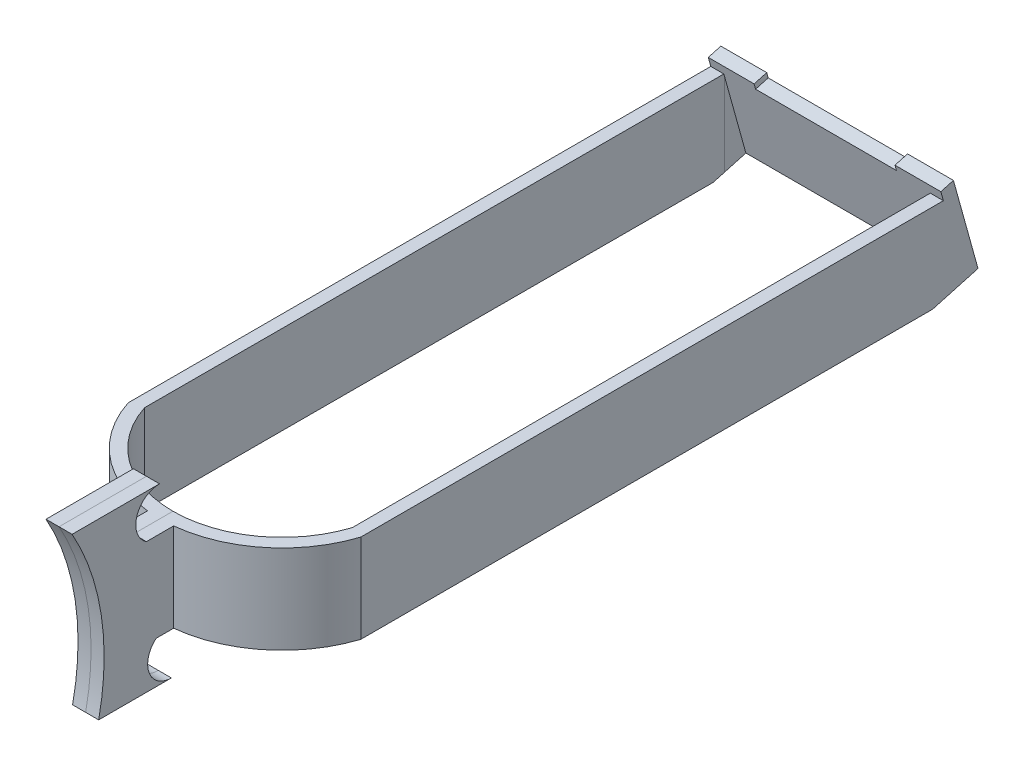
ISO-10303-21;
HEADER;
FILE_DESCRIPTION(('STEP AP214'),'2;1');
FILE_NAME('part.step','',(''),(''),'','','');
FILE_SCHEMA(('AUTOMOTIVE_DESIGN { 1 0 10303 214 1 1 1 1 }'));
ENDSEC;
DATA;
#1=APPLICATION_CONTEXT('core data for automotive mechanical design processes');
#2=APPLICATION_PROTOCOL_DEFINITION('international standard','automotive_design',2000,#1);
#3=PRODUCT_CONTEXT('',#1,'mechanical');
#4=PRODUCT('Part','Part','',(#3));
#5=PRODUCT_RELATED_PRODUCT_CATEGORY('part','',(#4));
#6=PRODUCT_DEFINITION_FORMATION('','',#4);
#7=PRODUCT_DEFINITION_CONTEXT('part definition',#1,'design');
#8=PRODUCT_DEFINITION('design','',#6,#7);
#9=PRODUCT_DEFINITION_SHAPE('','',#8);
#10=(LENGTH_UNIT() NAMED_UNIT(*) SI_UNIT(.MILLI.,.METRE.));
#11=(NAMED_UNIT(*) PLANE_ANGLE_UNIT() SI_UNIT($,.RADIAN.));
#12=(NAMED_UNIT(*) SI_UNIT($,.STERADIAN.) SOLID_ANGLE_UNIT());
#13=UNCERTAINTY_MEASURE_WITH_UNIT(LENGTH_MEASURE(1.E-05),#10,'distance_accuracy_value','');
#14=(GEOMETRIC_REPRESENTATION_CONTEXT(3) GLOBAL_UNCERTAINTY_ASSIGNED_CONTEXT((#13)) GLOBAL_UNIT_ASSIGNED_CONTEXT((#10,
#11,#12)) REPRESENTATION_CONTEXT('',''));
#15=CARTESIAN_POINT('',(0.,0.,0.));
#16=DIRECTION('',(0.,0.,1.));
#17=DIRECTION('',(1.,0.,0.));
#18=AXIS2_PLACEMENT_3D('',#15,#16,#17);
#19=CARTESIAN_POINT('',(7.4676,-0.635000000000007,33.90906949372));
#20=DIRECTION('',(0.,1.,0.));
#21=DIRECTION('',(0.,0.,1.));
#22=AXIS2_PLACEMENT_3D('',#19,#20,#21);
#23=PLANE('',#22);
#24=DIRECTION('',(0.,0.,-1.));
#25=VECTOR('',#24,1.);
#26=CARTESIAN_POINT('',(-7.4676,-0.635000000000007,33.90906949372));
#27=LINE('',#26,#25);
#28=CARTESIAN_POINT('',(-7.4676,-0.635000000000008,27.3991303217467));
#29=VERTEX_POINT('',#28);
#30=CARTESIAN_POINT('',(-7.4676,-0.635000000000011,-9.32268203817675));
#31=VERTEX_POINT('',#30);
#32=EDGE_CURVE('E300',#29,#31,#27,.T.);
#33=ORIENTED_EDGE('',*,*,#32,.T.);
#34=DIRECTION('',(1.,0.,0.));
#35=VECTOR('',#34,1.);
#36=CARTESIAN_POINT('',(7.4676,-0.635000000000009,-9.32268203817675));
#37=LINE('',#36,#35);
#38=CARTESIAN_POINT('',(-6.63018837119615,-0.63500000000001,-9.32268203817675));
#39=VERTEX_POINT('',#38);
#40=EDGE_CURVE('E279',#31,#39,#37,.T.);
#41=ORIENTED_EDGE('',*,*,#40,.T.);
#42=DIRECTION('',(-0.00109426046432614,0.,0.999999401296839));
#43=VECTOR('',#42,1.);
#44=CARTESIAN_POINT('',(-6.67747825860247,-0.635000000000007,33.8935910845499));
#45=LINE('',#44,#43);
#46=CARTESIAN_POINT('',(-6.67008932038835,-0.635000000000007,27.1411459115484));
#47=VERTEX_POINT('',#46);
#48=EDGE_CURVE('E476',#39,#47,#45,.T.);
#49=ORIENTED_EDGE('',*,*,#48,.T.);
#50=CARTESIAN_POINT('',(0.,-0.635000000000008,24.9834581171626));
#51=DIRECTION('',(0.,1.,0.));
#52=DIRECTION('',(0.,0.,1.));
#53=AXIS2_PLACEMENT_3D('',#50,#51,#52);
#54=CIRCLE('',#53,7.0104);
#55=CARTESIAN_POINT('',(0.,-0.635000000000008,31.9938581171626));
#56=VERTEX_POINT('',#55);
#57=EDGE_CURVE('E482',#47,#56,#54,.T.);
#58=ORIENTED_EDGE('',*,*,#57,.T.);
#59=DIRECTION('',(0.,0.,-1.));
#60=VECTOR('',#59,1.);
#61=CARTESIAN_POINT('',(0.,-0.635000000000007,33.90906949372));
#62=LINE('',#61,#60);
#63=CARTESIAN_POINT('',(0.,-0.635000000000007,33.90906949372));
#64=VERTEX_POINT('',#63);
#65=EDGE_CURVE('E86',#64,#56,#62,.T.);
#66=ORIENTED_EDGE('',*,*,#65,.F.);
#67=DIRECTION('',(-1.,0.,0.));
#68=VECTOR('',#67,1.);
#69=CARTESIAN_POINT('',(7.4676,-0.635000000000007,33.90906949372));
#70=LINE('',#69,#68);
#71=CARTESIAN_POINT('',(-0.838200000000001,-0.635000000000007,33.90906949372));
#72=VERTEX_POINT('',#71);
#73=EDGE_CURVE('E311',#64,#72,#70,.T.);
#74=ORIENTED_EDGE('',*,*,#73,.T.);
#75=DIRECTION('',(0.,0.,1.));
#76=VECTOR('',#75,1.);
#77=CARTESIAN_POINT('',(-0.838200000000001,-0.635000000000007,33.90906949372));
#78=LINE('',#77,#76);
#79=CARTESIAN_POINT('',(-0.838200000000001,-0.635000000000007,32.787171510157));
#80=VERTEX_POINT('',#79);
#81=EDGE_CURVE('E431',#80,#72,#78,.T.);
#82=ORIENTED_EDGE('',*,*,#81,.F.);
#83=CARTESIAN_POINT('',(0.,-0.635000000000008,24.9834581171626));
#84=DIRECTION('',(0.,1.,0.));
#85=DIRECTION('',(0.,0.,1.));
#86=AXIS2_PLACEMENT_3D('',#83,#84,#85);
#87=CIRCLE('',#86,7.8486);
#88=EDGE_CURVE('E438',#29,#80,#87,.T.);
#89=ORIENTED_EDGE('',*,*,#88,.F.);
#90=EDGE_LOOP('',(#33,#41,#49,#58,#66,#74,#82,#89));
#91=FACE_BOUND('',#90,.T.);
#92=ADVANCED_FACE('F78',(#91),#23,.F.);
#93=CARTESIAN_POINT('',(7.4676,5.05459999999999,34.53501508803));
#94=DIRECTION('',(0.,-1.,0.));
#95=DIRECTION('',(0.,0.,-1.));
#96=AXIS2_PLACEMENT_3D('',#93,#94,#95);
#97=PLANE('',#96);
#98=DIRECTION('',(1.,0.,0.));
#99=VECTOR('',#98,1.);
#100=CARTESIAN_POINT('',(7.4676,5.05459999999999,-10.0115063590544));
#101=LINE('',#100,#99);
#102=CARTESIAN_POINT('',(-7.4676,5.05459999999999,-10.0115063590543));
#103=VERTEX_POINT('',#102);
#104=CARTESIAN_POINT('',(-6.62943461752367,5.05459999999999,-10.0115063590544));
#105=VERTEX_POINT('',#104);
#106=EDGE_CURVE('E100',#103,#105,#101,.T.);
#107=ORIENTED_EDGE('',*,*,#106,.F.);
#108=DIRECTION('',(0.,0.,1.));
#109=VECTOR('',#108,1.);
#110=CARTESIAN_POINT('',(-7.4676,5.05459999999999,34.53501508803));
#111=LINE('',#110,#109);
#112=CARTESIAN_POINT('',(-7.4676,5.05459999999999,27.3991303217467));
#113=VERTEX_POINT('',#112);
#114=EDGE_CURVE('E299',#103,#113,#111,.T.);
#115=ORIENTED_EDGE('',*,*,#114,.T.);
#116=CARTESIAN_POINT('',(0.,5.05459999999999,24.9834581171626));
#117=DIRECTION('',(0.,-1.,0.));
#118=DIRECTION('',(0.,0.,-1.));
#119=AXIS2_PLACEMENT_3D('',#116,#117,#118);
#120=CIRCLE('',#119,7.8486);
#121=CARTESIAN_POINT('',(-0.838200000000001,5.05459999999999,32.787171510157));
#122=VERTEX_POINT('',#121);
#123=EDGE_CURVE('E435',#122,#113,#120,.T.);
#124=ORIENTED_EDGE('',*,*,#123,.F.);
#125=DIRECTION('',(0.,0.,-1.));
#126=VECTOR('',#125,1.);
#127=CARTESIAN_POINT('',(-0.838200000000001,5.05459999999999,34.53501508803));
#128=LINE('',#127,#126);
#129=CARTESIAN_POINT('',(-0.838200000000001,5.05459999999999,34.53501508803));
#130=VERTEX_POINT('',#129);
#131=EDGE_CURVE('E393',#130,#122,#128,.T.);
#132=ORIENTED_EDGE('',*,*,#131,.F.);
#133=DIRECTION('',(-1.,0.,0.));
#134=VECTOR('',#133,1.);
#135=CARTESIAN_POINT('',(7.4676,5.05459999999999,34.53501508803));
#136=LINE('',#135,#134);
#137=CARTESIAN_POINT('',(0.,5.05459999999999,34.53501508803));
#138=VERTEX_POINT('',#137);
#139=EDGE_CURVE('E312',#138,#130,#136,.T.);
#140=ORIENTED_EDGE('',*,*,#139,.F.);
#141=DIRECTION('',(0.,0.,1.));
#142=VECTOR('',#141,1.);
#143=CARTESIAN_POINT('',(0.,5.05459999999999,34.53501508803));
#144=LINE('',#143,#142);
#145=CARTESIAN_POINT('',(0.,5.05459999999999,31.9938581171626));
#146=VERTEX_POINT('',#145);
#147=EDGE_CURVE('E359',#146,#138,#144,.T.);
#148=ORIENTED_EDGE('',*,*,#147,.F.);
#149=CARTESIAN_POINT('',(0.,5.05459999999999,24.9834581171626));
#150=DIRECTION('',(0.,-1.,0.));
#151=DIRECTION('',(0.,0.,-1.));
#152=AXIS2_PLACEMENT_3D('',#149,#150,#151);
#153=CIRCLE('',#152,7.0104);
#154=CARTESIAN_POINT('',(-6.67008932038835,5.05459999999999,27.1411459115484));
#155=VERTEX_POINT('',#154);
#156=EDGE_CURVE('E343',#146,#155,#153,.T.);
#157=ORIENTED_EDGE('',*,*,#156,.T.);
#158=DIRECTION('',(0.00109426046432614,0.,-0.999999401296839));
#159=VECTOR('',#158,1.);
#160=CARTESIAN_POINT('',(-6.67816320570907,5.05459999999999,34.5195359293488));
#161=LINE('',#160,#159);
#162=EDGE_CURVE('E349',#155,#105,#161,.T.);
#163=ORIENTED_EDGE('',*,*,#162,.T.);
#164=EDGE_LOOP('',(#107,#115,#124,#132,#140,#148,#157,#163));
#165=FACE_BOUND('',#164,.T.);
#166=ADVANCED_FACE('F433',(#165),#97,.F.);
#167=DIRECTION('',(1.,0.,0.));
#168=VECTOR('',#167,1.);
#169=CARTESIAN_POINT('',(7.4676,5.05459999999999,-10.0115063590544));
#170=LINE('',#169,#168);
#171=CARTESIAN_POINT('',(6.62943461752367,5.05459999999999,-10.0115063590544));
#172=VERTEX_POINT('',#171);
#173=CARTESIAN_POINT('',(7.4676,5.05459999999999,-10.0115063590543));
#174=VERTEX_POINT('',#173);
#175=EDGE_CURVE('E490',#172,#174,#170,.T.);
#176=ORIENTED_EDGE('',*,*,#175,.F.);
#177=DIRECTION('',(0.00109426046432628,0.,0.999999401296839));
#178=VECTOR('',#177,1.);
#179=CARTESIAN_POINT('',(6.67818108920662,5.05459999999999,34.535878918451));
#180=LINE('',#179,#178);
#181=CARTESIAN_POINT('',(6.67008932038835,5.05459999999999,27.1411459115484));
#182=VERTEX_POINT('',#181);
#183=EDGE_CURVE('E347',#172,#182,#180,.T.);
#184=ORIENTED_EDGE('',*,*,#183,.T.);
#185=EDGE_CURVE('E344',#182,#146,#153,.T.);
#186=ORIENTED_EDGE('',*,*,#185,.T.);
#187=ORIENTED_EDGE('',*,*,#147,.T.);
#188=CARTESIAN_POINT('',(0.838199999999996,5.05459999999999,34.53501508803));
#189=VERTEX_POINT('',#188);
#190=EDGE_CURVE('E308',#189,#138,#136,.T.);
#191=ORIENTED_EDGE('',*,*,#190,.F.);
#192=DIRECTION('',(0.,0.,-1.));
#193=VECTOR('',#192,1.);
#194=CARTESIAN_POINT('',(0.838199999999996,5.05459999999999,34.53501508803));
#195=LINE('',#194,#193);
#196=CARTESIAN_POINT('',(0.838199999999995,5.05459999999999,32.787171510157));
#197=VERTEX_POINT('',#196);
#198=EDGE_CURVE('E335',#189,#197,#195,.T.);
#199=ORIENTED_EDGE('',*,*,#198,.T.);
#200=CARTESIAN_POINT('',(0.,5.05459999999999,24.9834581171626));
#201=DIRECTION('',(0.,-1.,0.));
#202=DIRECTION('',(0.,0.,-1.));
#203=AXIS2_PLACEMENT_3D('',#200,#201,#202);
#204=CIRCLE('',#203,7.8486);
#205=CARTESIAN_POINT('',(7.4676,5.05459999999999,27.3991303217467));
#206=VERTEX_POINT('',#205);
#207=EDGE_CURVE('E396',#206,#197,#204,.T.);
#208=ORIENTED_EDGE('',*,*,#207,.F.);
#209=DIRECTION('',(0.,0.,1.));
#210=VECTOR('',#209,1.);
#211=CARTESIAN_POINT('',(7.4676,5.05459999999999,34.53501508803));
#212=LINE('',#211,#210);
#213=EDGE_CURVE('E418',#174,#206,#212,.T.);
#214=ORIENTED_EDGE('',*,*,#213,.F.);
#215=EDGE_LOOP('',(#176,#184,#186,#187,#191,#199,#208,#214));
#216=FACE_BOUND('',#215,.T.);
#217=ADVANCED_FACE('F618',(#216),#97,.F.);
#218=CARTESIAN_POINT('',(-6.65598255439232,-7.08660000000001,14.2495556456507));
#219=DIRECTION('',(-0.999999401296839,0.,-0.00109426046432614));
#220=DIRECTION('',(-0.00109426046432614,0.,0.999999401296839));
#221=AXIS2_PLACEMENT_3D('',#218,#219,#220);
#222=PLANE('',#221);
#223=ORIENTED_EDGE('',*,*,#48,.F.);
#224=DIRECTION('',(0.00105446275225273,0.267238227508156,-0.963629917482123));
#225=VECTOR('',#224,1.);
#226=CARTESIAN_POINT('',(-6.65595844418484,-7.16604968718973,14.227522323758));
#227=LINE('',#226,#225);
#228=CARTESIAN_POINT('',(-6.6294,-0.435198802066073,-10.0431418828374));
#229=VERTEX_POINT('',#228);
#230=EDGE_CURVE('E554',#39,#229,#227,.T.);
#231=ORIENTED_EDGE('',*,*,#230,.T.);
#232=DIRECTION('',(0.,1.,0.));
#233=VECTOR('',#232,1.);
#234=CARTESIAN_POINT('',(-6.6294,-7.08660000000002,-10.0431418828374));
#235=LINE('',#234,#233);
#236=CARTESIAN_POINT('',(-6.6294,4.94052598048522,-10.0431418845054));
#237=VERTEX_POINT('',#236);
#238=EDGE_CURVE('E495',#229,#237,#235,.T.);
#239=ORIENTED_EDGE('',*,*,#238,.T.);
#240=DIRECTION('',(0.000292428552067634,-0.963630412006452,-0.26723836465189));
#241=VECTOR('',#240,1.);
#242=CARTESIAN_POINT('',(-6.6279092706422,0.0281734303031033,-11.4054578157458));
#243=LINE('',#242,#241);
#244=EDGE_CURVE('E503',#105,#237,#243,.T.);
#245=ORIENTED_EDGE('',*,*,#244,.F.);
#246=ORIENTED_EDGE('',*,*,#162,.F.);
#247=DIRECTION('',(0.,1.,0.));
#248=VECTOR('',#247,1.);
#249=CARTESIAN_POINT('',(-6.67008932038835,-7.08660000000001,27.1411459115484));
#250=LINE('',#249,#248);
#251=EDGE_CURVE('E486',#47,#155,#250,.T.);
#252=ORIENTED_EDGE('',*,*,#251,.F.);
#253=EDGE_LOOP('',(#223,#231,#239,#245,#246,#252));
#254=FACE_BOUND('',#253,.T.);
#255=ADVANCED_FACE('F592',(#254),#222,.F.);
#256=CARTESIAN_POINT('',(6.65588467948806,-7.08660000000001,14.1601118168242));
#257=DIRECTION('',(0.999999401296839,0.,-0.00109426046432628));
#258=DIRECTION('',(-0.00109426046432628,0.,-0.999999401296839));
#259=AXIS2_PLACEMENT_3D('',#256,#257,#258);
#260=PLANE('',#259);
#261=DIRECTION('',(0.,1.,0.));
#262=VECTOR('',#261,1.);
#263=CARTESIAN_POINT('',(6.6294,-7.08660000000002,-10.0431418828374));
#264=LINE('',#263,#262);
#265=CARTESIAN_POINT('',(6.6294,-0.435198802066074,-10.0431418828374));
#266=VERTEX_POINT('',#265);
#267=CARTESIAN_POINT('',(6.6294,4.94052598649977,-10.0431418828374));
#268=VERTEX_POINT('',#267);
#269=EDGE_CURVE('E493',#266,#268,#264,.T.);
#270=ORIENTED_EDGE('',*,*,#269,.F.);
#271=DIRECTION('',(0.00105446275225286,-0.267238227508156,0.963629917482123));
#272=VECTOR('',#271,1.);
#273=CARTESIAN_POINT('',(6.65586755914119,-7.14301619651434,14.1444662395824));
#274=LINE('',#273,#272);
#275=CARTESIAN_POINT('',(6.63018837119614,-0.635000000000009,-9.32268203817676));
#276=VERTEX_POINT('',#275);
#277=EDGE_CURVE('E93',#266,#276,#274,.T.);
#278=ORIENTED_EDGE('',*,*,#277,.T.);
#279=DIRECTION('',(-0.00109426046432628,0.,-0.999999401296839));
#280=VECTOR('',#279,1.);
#281=CARTESIAN_POINT('',(6.67749614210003,-0.635000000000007,33.9099340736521));
#282=LINE('',#281,#280);
#283=CARTESIAN_POINT('',(6.67008932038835,-0.635000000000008,27.1411459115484));
#284=VERTEX_POINT('',#283);
#285=EDGE_CURVE('E477',#284,#276,#282,.T.);
#286=ORIENTED_EDGE('',*,*,#285,.F.);
#287=DIRECTION('',(0.,1.,0.));
#288=VECTOR('',#287,1.);
#289=CARTESIAN_POINT('',(6.67008932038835,-7.08660000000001,27.1411459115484));
#290=LINE('',#289,#288);
#291=EDGE_CURVE('E489',#284,#182,#290,.T.);
#292=ORIENTED_EDGE('',*,*,#291,.T.);
#293=ORIENTED_EDGE('',*,*,#183,.F.);
#294=DIRECTION('',(0.000292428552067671,0.963630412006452,0.26723836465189));
#295=VECTOR('',#294,1.);
#296=CARTESIAN_POINT('',(6.62790228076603,0.00513991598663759,-11.4118455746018));
#297=LINE('',#296,#295);
#298=EDGE_CURVE('E499',#268,#172,#297,.T.);
#299=ORIENTED_EDGE('',*,*,#298,.F.);
#300=EDGE_LOOP('',(#270,#278,#286,#292,#293,#299));
#301=FACE_BOUND('',#300,.T.);
#302=ADVANCED_FACE('F578',(#301),#260,.F.);
#303=CARTESIAN_POINT('',(7.4676,6.32459999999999,33.6925923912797));
#304=DIRECTION('',(-1.,0.,0.));
#305=DIRECTION('',(0.,0.,1.));
#306=AXIS2_PLACEMENT_3D('',#303,#304,#305);
#307=CYLINDRICAL_SURFACE('',#306,1.524);
#308=CARTESIAN_POINT('',(0.,6.32459999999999,33.6925923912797));
#309=DIRECTION('',(1.,0.,0.));
#310=DIRECTION('',(0.,0.,-1.));
#311=AXIS2_PLACEMENT_3D('',#308,#309,#310);
#312=CIRCLE('',#311,1.524);
#313=CARTESIAN_POINT('',(0.,7.84859999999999,33.6925923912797));
#314=VERTEX_POINT('',#313);
#315=EDGE_CURVE('E357',#138,#314,#312,.F.);
#316=ORIENTED_EDGE('',*,*,#315,.F.);
#317=ORIENTED_EDGE('',*,*,#139,.T.);
#318=CARTESIAN_POINT('',(-0.838200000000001,6.32459999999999,33.6925923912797));
#319=DIRECTION('',(-1.,0.,0.));
#320=DIRECTION('',(0.,0.,1.));
#321=AXIS2_PLACEMENT_3D('',#318,#319,#320);
#322=CIRCLE('',#321,1.524);
#323=CARTESIAN_POINT('',(-0.8382,7.84859999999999,33.6925923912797));
#324=VERTEX_POINT('',#323);
#325=EDGE_CURVE('E380',#324,#130,#322,.F.);
#326=ORIENTED_EDGE('',*,*,#325,.F.);
#327=DIRECTION('',(-1.,0.,0.));
#328=VECTOR('',#327,1.);
#329=CARTESIAN_POINT('',(7.4676,7.84859999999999,33.6925923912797));
#330=LINE('',#329,#328);
#331=EDGE_CURVE('E328',#314,#324,#330,.T.);
#332=ORIENTED_EDGE('',*,*,#331,.F.);
#333=EDGE_LOOP('',(#316,#317,#326,#332));
#334=FACE_BOUND('',#333,.T.);
#335=ADVANCED_FACE('F378',(#334),#307,.F.);
#336=CARTESIAN_POINT('',(7.4676,7.8486,39.3055760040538));
#337=DIRECTION('',(0.,-1.,0.));
#338=DIRECTION('',(0.,0.,-1.));
#339=AXIS2_PLACEMENT_3D('',#336,#337,#338);
#340=PLANE('',#339);
#341=DIRECTION('',(0.,0.,1.));
#342=VECTOR('',#341,1.);
#343=CARTESIAN_POINT('',(0.,7.8486,39.3055760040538));
#344=LINE('',#343,#342);
#345=CARTESIAN_POINT('',(0.,7.8486,39.3055760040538));
#346=VERTEX_POINT('',#345);
#347=EDGE_CURVE('E354',#314,#346,#344,.T.);
#348=ORIENTED_EDGE('',*,*,#347,.F.);
#349=ORIENTED_EDGE('',*,*,#331,.T.);
#350=DIRECTION('',(0.,0.,1.));
#351=VECTOR('',#350,1.);
#352=CARTESIAN_POINT('',(-0.838200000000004,7.84859999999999,14.2121170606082));
#353=LINE('',#352,#351);
#354=CARTESIAN_POINT('',(-0.838199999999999,7.8486,39.3055760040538));
#355=VERTEX_POINT('',#354);
#356=EDGE_CURVE('E430',#324,#355,#353,.T.);
#357=ORIENTED_EDGE('',*,*,#356,.T.);
#358=DIRECTION('',(-1.,0.,0.));
#359=VECTOR('',#358,1.);
#360=CARTESIAN_POINT('',(7.4676,7.8486,39.3055760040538));
#361=LINE('',#360,#359);
#362=EDGE_CURVE('E324',#346,#355,#361,.T.);
#363=ORIENTED_EDGE('',*,*,#362,.F.);
#364=EDGE_LOOP('',(#348,#349,#357,#363));
#365=FACE_BOUND('',#364,.T.);
#366=ADVANCED_FACE('F475',(#365),#340,.F.);
#367=CARTESIAN_POINT('',(7.4676,0.,53.2505923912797));
#368=DIRECTION('',(-1.,0.,0.));
#369=DIRECTION('',(0.,0.,1.));
#370=AXIS2_PLACEMENT_3D('',#367,#368,#369);
#371=CYLINDRICAL_SURFACE('',#370,16.002);
#372=CARTESIAN_POINT('',(0.,0.,53.2505923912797));
#373=DIRECTION('',(1.,0.,0.));
#374=DIRECTION('',(0.,0.,-1.));
#375=AXIS2_PLACEMENT_3D('',#372,#373,#374);
#376=CIRCLE('',#375,16.002);
#377=CARTESIAN_POINT('',(0.,-3.32740000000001,37.5983589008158));
#378=VERTEX_POINT('',#377);
#379=EDGE_CURVE('E358',#346,#378,#376,.F.);
#380=ORIENTED_EDGE('',*,*,#379,.F.);
#381=ORIENTED_EDGE('',*,*,#362,.T.);
#382=CARTESIAN_POINT('',(-0.838199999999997,0.,53.2505923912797));
#383=DIRECTION('',(-1.,0.,0.));
#384=DIRECTION('',(0.,0.,1.));
#385=AXIS2_PLACEMENT_3D('',#382,#383,#384);
#386=CIRCLE('',#385,16.002);
#387=CARTESIAN_POINT('',(-0.838199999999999,-3.32740000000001,37.5983589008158));
#388=VERTEX_POINT('',#387);
#389=EDGE_CURVE('E448',#388,#355,#386,.F.);
#390=ORIENTED_EDGE('',*,*,#389,.F.);
#391=DIRECTION('',(-1.,0.,0.));
#392=VECTOR('',#391,1.);
#393=CARTESIAN_POINT('',(7.4676,-3.32740000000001,37.5983589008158));
#394=LINE('',#393,#392);
#395=EDGE_CURVE('E320',#378,#388,#394,.T.);
#396=ORIENTED_EDGE('',*,*,#395,.F.);
#397=EDGE_LOOP('',(#380,#381,#390,#396));
#398=FACE_BOUND('',#397,.T.);
#399=ADVANCED_FACE('F474',(#398),#371,.F.);
#400=CARTESIAN_POINT('',(7.4676,-3.32740000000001,37.5983589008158));
#401=DIRECTION('',(0.,1.,0.));
#402=DIRECTION('',(0.,0.,1.));
#403=AXIS2_PLACEMENT_3D('',#400,#401,#402);
#404=PLANE('',#403);
#405=DIRECTION('',(0.,0.,-1.));
#406=VECTOR('',#405,1.);
#407=CARTESIAN_POINT('',(0.,-3.32740000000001,37.5983589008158));
#408=LINE('',#407,#406);
#409=CARTESIAN_POINT('',(0.,-3.32740000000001,32.9305923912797));
#410=VERTEX_POINT('',#409);
#411=EDGE_CURVE('E366',#378,#410,#408,.T.);
#412=ORIENTED_EDGE('',*,*,#411,.F.);
#413=ORIENTED_EDGE('',*,*,#395,.T.);
#414=DIRECTION('',(0.,0.,1.));
#415=VECTOR('',#414,1.);
#416=CARTESIAN_POINT('',(-0.838199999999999,-3.32740000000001,37.5983589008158));
#417=LINE('',#416,#415);
#418=CARTESIAN_POINT('',(-0.838200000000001,-3.32740000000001,32.9305923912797));
#419=VERTEX_POINT('',#418);
#420=EDGE_CURVE('E441',#419,#388,#417,.T.);
#421=ORIENTED_EDGE('',*,*,#420,.F.);
#422=DIRECTION('',(-1.,0.,0.));
#423=VECTOR('',#422,1.);
#424=CARTESIAN_POINT('',(7.4676,-3.32740000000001,32.9305923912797));
#425=LINE('',#424,#423);
#426=EDGE_CURVE('E316',#410,#419,#425,.T.);
#427=ORIENTED_EDGE('',*,*,#426,.F.);
#428=EDGE_LOOP('',(#412,#413,#421,#427));
#429=FACE_BOUND('',#428,.T.);
#430=ADVANCED_FACE('F461',(#429),#404,.F.);
#431=CARTESIAN_POINT('',(7.4676,-1.80340000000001,32.9305923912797));
#432=DIRECTION('',(-1.,0.,0.));
#433=DIRECTION('',(0.,0.,1.));
#434=AXIS2_PLACEMENT_3D('',#431,#432,#433);
#435=CYLINDRICAL_SURFACE('',#434,1.524);
#436=CARTESIAN_POINT('',(0.,-1.80340000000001,32.9305923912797));
#437=DIRECTION('',(1.,0.,0.));
#438=DIRECTION('',(0.,0.,-1.));
#439=AXIS2_PLACEMENT_3D('',#436,#437,#438);
#440=CIRCLE('',#439,1.524);
#441=EDGE_CURVE('E353',#410,#64,#440,.F.);
#442=ORIENTED_EDGE('',*,*,#441,.F.);
#443=ORIENTED_EDGE('',*,*,#426,.T.);
#444=CARTESIAN_POINT('',(-0.838200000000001,-1.80340000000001,32.9305923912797));
#445=DIRECTION('',(-1.,0.,0.));
#446=DIRECTION('',(0.,0.,1.));
#447=AXIS2_PLACEMENT_3D('',#444,#445,#446);
#448=CIRCLE('',#447,1.524);
#449=EDGE_CURVE('E340',#72,#419,#448,.F.);
#450=ORIENTED_EDGE('',*,*,#449,.F.);
#451=ORIENTED_EDGE('',*,*,#73,.F.);
#452=EDGE_LOOP('',(#442,#443,#450,#451));
#453=FACE_BOUND('',#452,.T.);
#454=ADVANCED_FACE('F458',(#453),#435,.F.);
#455=CARTESIAN_POINT('',(0.,-7.08660000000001,24.9834581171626));
#456=DIRECTION('',(0.,1.,0.));
#457=DIRECTION('',(0.,0.,1.));
#458=AXIS2_PLACEMENT_3D('',#455,#456,#457);
#459=CYLINDRICAL_SURFACE('',#458,7.0104);
#460=DIRECTION('',(0.,1.,0.));
#461=VECTOR('',#460,1.);
#462=CARTESIAN_POINT('',(0.,-7.08660000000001,31.9938581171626));
#463=LINE('',#462,#461);
#464=EDGE_CURVE('E351',#56,#146,#463,.T.);
#465=ORIENTED_EDGE('',*,*,#464,.F.);
#466=ORIENTED_EDGE('',*,*,#57,.F.);
#467=ORIENTED_EDGE('',*,*,#251,.T.);
#468=ORIENTED_EDGE('',*,*,#156,.F.);
#469=EDGE_LOOP('',(#465,#466,#467,#468));
#470=FACE_BOUND('',#469,.T.);
#471=ADVANCED_FACE('F607',(#470),#459,.F.);
#472=ORIENTED_EDGE('',*,*,#285,.T.);
#473=CARTESIAN_POINT('',(7.4676,-0.635000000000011,-9.32268203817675));
#474=VERTEX_POINT('',#473);
#475=EDGE_CURVE('E557',#276,#474,#37,.T.);
#476=ORIENTED_EDGE('',*,*,#475,.T.);
#477=DIRECTION('',(0.,0.,-1.));
#478=VECTOR('',#477,1.);
#479=CARTESIAN_POINT('',(7.4676,-0.635000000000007,33.90906949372));
#480=LINE('',#479,#478);
#481=CARTESIAN_POINT('',(7.4676,-0.635000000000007,27.3991303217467));
#482=VERTEX_POINT('',#481);
#483=EDGE_CURVE('E302',#482,#474,#480,.T.);
#484=ORIENTED_EDGE('',*,*,#483,.F.);
#485=CARTESIAN_POINT('',(0.,-0.635000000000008,24.9834581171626));
#486=DIRECTION('',(0.,1.,0.));
#487=DIRECTION('',(0.,0.,1.));
#488=AXIS2_PLACEMENT_3D('',#485,#486,#487);
#489=CIRCLE('',#488,7.8486);
#490=CARTESIAN_POINT('',(0.838199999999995,-0.635000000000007,32.787171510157));
#491=VERTEX_POINT('',#490);
#492=EDGE_CURVE('E402',#491,#482,#489,.T.);
#493=ORIENTED_EDGE('',*,*,#492,.F.);
#494=DIRECTION('',(0.,0.,1.));
#495=VECTOR('',#494,1.);
#496=CARTESIAN_POINT('',(0.838199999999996,-0.635000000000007,33.90906949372));
#497=LINE('',#496,#495);
#498=CARTESIAN_POINT('',(0.838199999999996,-0.635000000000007,33.90906949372));
#499=VERTEX_POINT('',#498);
#500=EDGE_CURVE('E406',#491,#499,#497,.T.);
#501=ORIENTED_EDGE('',*,*,#500,.T.);
#502=EDGE_CURVE('E313',#499,#64,#70,.T.);
#503=ORIENTED_EDGE('',*,*,#502,.T.);
#504=ORIENTED_EDGE('',*,*,#65,.T.);
#505=EDGE_CURVE('E485',#56,#284,#54,.T.);
#506=ORIENTED_EDGE('',*,*,#505,.T.);
#507=EDGE_LOOP('',(#472,#476,#484,#493,#501,#503,#504,#506));
#508=FACE_BOUND('',#507,.T.);
#509=ADVANCED_FACE('F571',(#508),#23,.F.);
#510=ORIENTED_EDGE('',*,*,#190,.T.);
#511=ORIENTED_EDGE('',*,*,#315,.T.);
#512=CARTESIAN_POINT('',(0.838199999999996,7.84859999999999,33.6925923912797));
#513=VERTEX_POINT('',#512);
#514=EDGE_CURVE('E329',#513,#314,#330,.T.);
#515=ORIENTED_EDGE('',*,*,#514,.F.);
#516=CARTESIAN_POINT('',(0.838199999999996,6.32459999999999,33.6925923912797));
#517=DIRECTION('',(-1.,0.,0.));
#518=DIRECTION('',(0.,0.,1.));
#519=AXIS2_PLACEMENT_3D('',#516,#517,#518);
#520=CIRCLE('',#519,1.524);
#521=EDGE_CURVE('E404',#513,#189,#520,.F.);
#522=ORIENTED_EDGE('',*,*,#521,.T.);
#523=EDGE_LOOP('',(#510,#511,#515,#522));
#524=FACE_BOUND('',#523,.T.);
#525=ADVANCED_FACE('F80',(#524),#307,.F.);
#526=ORIENTED_EDGE('',*,*,#514,.T.);
#527=ORIENTED_EDGE('',*,*,#347,.T.);
#528=CARTESIAN_POINT('',(0.838199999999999,7.8486,39.3055760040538));
#529=VERTEX_POINT('',#528);
#530=EDGE_CURVE('E325',#529,#346,#361,.T.);
#531=ORIENTED_EDGE('',*,*,#530,.F.);
#532=DIRECTION('',(0.,0.,1.));
#533=VECTOR('',#532,1.);
#534=CARTESIAN_POINT('',(0.838199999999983,7.84859999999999,14.2121170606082));
#535=LINE('',#534,#533);
#536=EDGE_CURVE('E389',#513,#529,#535,.T.);
#537=ORIENTED_EDGE('',*,*,#536,.F.);
#538=EDGE_LOOP('',(#526,#527,#531,#537));
#539=FACE_BOUND('',#538,.T.);
#540=ADVANCED_FACE('F386',(#539),#340,.F.);
#541=ORIENTED_EDGE('',*,*,#530,.T.);
#542=ORIENTED_EDGE('',*,*,#379,.T.);
#543=CARTESIAN_POINT('',(0.838199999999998,-3.32740000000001,37.5983589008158));
#544=VERTEX_POINT('',#543);
#545=EDGE_CURVE('E321',#544,#378,#394,.T.);
#546=ORIENTED_EDGE('',*,*,#545,.F.);
#547=CARTESIAN_POINT('',(0.838200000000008,0.,53.2505923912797));
#548=DIRECTION('',(-1.,0.,0.));
#549=DIRECTION('',(0.,0.,1.));
#550=AXIS2_PLACEMENT_3D('',#547,#548,#549);
#551=CIRCLE('',#550,16.002);
#552=EDGE_CURVE('E304',#544,#529,#551,.F.);
#553=ORIENTED_EDGE('',*,*,#552,.T.);
#554=EDGE_LOOP('',(#541,#542,#546,#553));
#555=FACE_BOUND('',#554,.T.);
#556=ADVANCED_FACE('F470',(#555),#371,.F.);
#557=ORIENTED_EDGE('',*,*,#545,.T.);
#558=ORIENTED_EDGE('',*,*,#411,.T.);
#559=CARTESIAN_POINT('',(0.838199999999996,-3.32740000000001,32.9305923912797));
#560=VERTEX_POINT('',#559);
#561=EDGE_CURVE('E317',#560,#410,#425,.T.);
#562=ORIENTED_EDGE('',*,*,#561,.F.);
#563=DIRECTION('',(0.,0.,1.));
#564=VECTOR('',#563,1.);
#565=CARTESIAN_POINT('',(0.838199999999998,-3.32740000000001,37.5983589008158));
#566=LINE('',#565,#564);
#567=EDGE_CURVE('E412',#560,#544,#566,.T.);
#568=ORIENTED_EDGE('',*,*,#567,.T.);
#569=EDGE_LOOP('',(#557,#558,#562,#568));
#570=FACE_BOUND('',#569,.T.);
#571=ADVANCED_FACE('F467',(#570),#404,.F.);
#572=ORIENTED_EDGE('',*,*,#561,.T.);
#573=ORIENTED_EDGE('',*,*,#441,.T.);
#574=ORIENTED_EDGE('',*,*,#502,.F.);
#575=CARTESIAN_POINT('',(0.838199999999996,-1.80340000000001,32.9305923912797));
#576=DIRECTION('',(-1.,0.,0.));
#577=DIRECTION('',(0.,0.,1.));
#578=AXIS2_PLACEMENT_3D('',#575,#576,#577);
#579=CIRCLE('',#578,1.524);
#580=EDGE_CURVE('E409',#499,#560,#579,.F.);
#581=ORIENTED_EDGE('',*,*,#580,.T.);
#582=EDGE_LOOP('',(#572,#573,#574,#581));
#583=FACE_BOUND('',#582,.T.);
#584=ADVANCED_FACE('F464',(#583),#435,.F.);
#585=CARTESIAN_POINT('',(-7.4676,6.32459999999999,33.6925923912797));
#586=DIRECTION('',(1.,0.,0.));
#587=DIRECTION('',(0.,0.,-1.));
#588=AXIS2_PLACEMENT_3D('',#585,#586,#587);
#589=PLANE('',#588);
#590=DIRECTION('',(0.,0.963630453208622,0.267238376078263));
#591=VECTOR('',#590,1.);
#592=CARTESIAN_POINT('',(-7.4676,-0.63500000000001,-12.4592076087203));
#593=LINE('',#592,#591);
#594=CARTESIAN_POINT('',(-7.4676,0.172715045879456,-12.2352084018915));
#595=VERTEX_POINT('',#594);
#596=CARTESIAN_POINT('',(-7.4676,5.86231504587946,-10.6573426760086));
#597=VERTEX_POINT('',#596);
#598=EDGE_CURVE('E290',#595,#597,#593,.T.);
#599=ORIENTED_EDGE('',*,*,#598,.F.);
#600=DIRECTION('',(0.,0.267238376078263,-0.963630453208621));
#601=VECTOR('',#600,1.);
#602=CARTESIAN_POINT('',(-7.4676,-13.349983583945,36.5260675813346));
#603=LINE('',#602,#601);
#604=EDGE_CURVE('E273',#31,#595,#603,.T.);
#605=ORIENTED_EDGE('',*,*,#604,.F.);
#606=ORIENTED_EDGE('',*,*,#32,.F.);
#607=DIRECTION('',(0.,1.,0.));
#608=VECTOR('',#607,1.);
#609=CARTESIAN_POINT('',(-7.4676,-7.08660000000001,27.3991303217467));
#610=LINE('',#609,#608);
#611=EDGE_CURVE('E338',#113,#29,#610,.F.);
#612=ORIENTED_EDGE('',*,*,#611,.F.);
#613=ORIENTED_EDGE('',*,*,#114,.F.);
#614=DIRECTION('',(0.,0.963630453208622,0.267238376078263));
#615=VECTOR('',#614,1.);
#616=CARTESIAN_POINT('',(-7.4676,2.15968683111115,-10.8143368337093));
#617=LINE('',#616,#615);
#618=CARTESIAN_POINT('',(-7.4676,5.63831583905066,-9.84962763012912));
#619=VERTEX_POINT('',#618);
#620=EDGE_CURVE('E546',#103,#619,#617,.T.);
#621=ORIENTED_EDGE('',*,*,#620,.T.);
#622=DIRECTION('',(0.,0.267238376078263,-0.963630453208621));
#623=VECTOR('',#622,1.);
#624=CARTESIAN_POINT('',(-7.4676,5.63831583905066,-9.84962763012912));
#625=LINE('',#624,#623);
#626=EDGE_CURVE('E297',#619,#597,#625,.T.);
#627=ORIENTED_EDGE('',*,*,#626,.T.);
#628=EDGE_LOOP('',(#599,#605,#606,#612,#613,#621,#627));
#629=FACE_BOUND('',#628,.T.);
#630=ADVANCED_FACE('F295',(#629),#589,.F.);
#631=CARTESIAN_POINT('',(7.4676,6.32459999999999,33.6925923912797));
#632=DIRECTION('',(1.,0.,0.));
#633=DIRECTION('',(0.,0.,-1.));
#634=AXIS2_PLACEMENT_3D('',#631,#632,#633);
#635=PLANE('',#634);
#636=DIRECTION('',(0.,0.267238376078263,-0.963630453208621));
#637=VECTOR('',#636,1.);
#638=CARTESIAN_POINT('',(7.4676,-13.349983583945,36.5260675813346));
#639=LINE('',#638,#637);
#640=CARTESIAN_POINT('',(7.4676,0.172715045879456,-12.2352084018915));
#641=VERTEX_POINT('',#640);
#642=EDGE_CURVE('E284',#474,#641,#639,.T.);
#643=ORIENTED_EDGE('',*,*,#642,.T.);
#644=DIRECTION('',(0.,0.963630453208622,0.267238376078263));
#645=VECTOR('',#644,1.);
#646=CARTESIAN_POINT('',(7.4676,-0.63500000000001,-12.4592076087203));
#647=LINE('',#646,#645);
#648=CARTESIAN_POINT('',(7.4676,5.86231504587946,-10.6573426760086));
#649=VERTEX_POINT('',#648);
#650=EDGE_CURVE('E293',#641,#649,#647,.T.);
#651=ORIENTED_EDGE('',*,*,#650,.T.);
#652=DIRECTION('',(0.,0.267238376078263,-0.963630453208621));
#653=VECTOR('',#652,1.);
#654=CARTESIAN_POINT('',(7.4676,5.63831583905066,-9.84962763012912));
#655=LINE('',#654,#653);
#656=CARTESIAN_POINT('',(7.4676,5.63831583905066,-9.84962763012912));
#657=VERTEX_POINT('',#656);
#658=EDGE_CURVE('E506',#657,#649,#655,.T.);
#659=ORIENTED_EDGE('',*,*,#658,.F.);
#660=DIRECTION('',(0.,-0.963630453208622,-0.267238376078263));
#661=VECTOR('',#660,1.);
#662=CARTESIAN_POINT('',(7.4676,2.15968683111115,-10.8143368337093));
#663=LINE('',#662,#661);
#664=EDGE_CURVE('E521',#657,#174,#663,.T.);
#665=ORIENTED_EDGE('',*,*,#664,.T.);
#666=ORIENTED_EDGE('',*,*,#213,.T.);
#667=DIRECTION('',(0.,1.,0.));
#668=VECTOR('',#667,1.);
#669=CARTESIAN_POINT('',(7.4676,-7.08660000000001,27.3991303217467));
#670=LINE('',#669,#668);
#671=EDGE_CURVE('E332',#206,#482,#670,.F.);
#672=ORIENTED_EDGE('',*,*,#671,.T.);
#673=ORIENTED_EDGE('',*,*,#483,.T.);
#674=EDGE_LOOP('',(#643,#651,#659,#665,#666,#672,#673));
#675=FACE_BOUND('',#674,.T.);
#676=ADVANCED_FACE('F567',(#675),#635,.T.);
#677=CARTESIAN_POINT('',(7.4676,-0.63500000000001,-12.4592076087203));
#678=DIRECTION('',(0.,-0.267238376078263,0.963630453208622));
#679=DIRECTION('',(0.,-0.963630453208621,-0.267238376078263));
#680=AXIS2_PLACEMENT_3D('',#677,#678,#679);
#681=PLANE('',#680);
#682=ORIENTED_EDGE('',*,*,#650,.F.);
#683=DIRECTION('',(1.,0.,0.));
#684=VECTOR('',#683,1.);
#685=CARTESIAN_POINT('',(7.4676,0.172715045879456,-12.2352084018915));
#686=LINE('',#685,#684);
#687=EDGE_CURVE('E276',#595,#641,#686,.T.);
#688=ORIENTED_EDGE('',*,*,#687,.F.);
#689=ORIENTED_EDGE('',*,*,#598,.T.);
#690=DIRECTION('',(1.,0.,0.));
#691=VECTOR('',#690,1.);
#692=CARTESIAN_POINT('',(-12.8850272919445,5.86231504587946,-10.6573426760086));
#693=LINE('',#692,#691);
#694=CARTESIAN_POINT('',(-4.5212,5.86231504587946,-10.6573426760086));
#695=VERTEX_POINT('',#694);
#696=EDGE_CURVE('E531',#597,#695,#693,.T.);
#697=ORIENTED_EDGE('',*,*,#696,.T.);
#698=DIRECTION('',(0.,-0.963630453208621,-0.267238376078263));
#699=VECTOR('',#698,1.);
#700=CARTESIAN_POINT('',(-4.5212,2.38368603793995,-11.6220518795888));
#701=LINE('',#700,#699);
#702=CARTESIAN_POINT('',(-4.5212,5.51964805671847,-10.752372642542));
#703=VERTEX_POINT('',#702);
#704=EDGE_CURVE('E528',#695,#703,#701,.T.);
#705=ORIENTED_EDGE('',*,*,#704,.T.);
#706=DIRECTION('',(1.,0.,0.));
#707=VECTOR('',#706,1.);
#708=CARTESIAN_POINT('',(-12.8850272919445,5.51964805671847,-10.752372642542));
#709=LINE('',#708,#707);
#710=CARTESIAN_POINT('',(4.5212,5.51964805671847,-10.752372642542));
#711=VERTEX_POINT('',#710);
#712=EDGE_CURVE('E525',#703,#711,#709,.T.);
#713=ORIENTED_EDGE('',*,*,#712,.T.);
#714=DIRECTION('',(0.,0.963630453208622,0.267238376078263));
#715=VECTOR('',#714,1.);
#716=CARTESIAN_POINT('',(4.5212,2.38368603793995,-11.6220518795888));
#717=LINE('',#716,#715);
#718=CARTESIAN_POINT('',(4.5212,5.86231504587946,-10.6573426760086));
#719=VERTEX_POINT('',#718);
#720=EDGE_CURVE('E522',#711,#719,#717,.T.);
#721=ORIENTED_EDGE('',*,*,#720,.T.);
#722=DIRECTION('',(1.,0.,0.));
#723=VECTOR('',#722,1.);
#724=CARTESIAN_POINT('',(-12.8850272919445,5.86231504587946,-10.6573426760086));
#725=LINE('',#724,#723);
#726=EDGE_CURVE('E519',#719,#649,#725,.T.);
#727=ORIENTED_EDGE('',*,*,#726,.T.);
#728=EDGE_LOOP('',(#682,#688,#689,#697,#705,#713,#721,#727));
#729=FACE_BOUND('',#728,.T.);
#730=ADVANCED_FACE('F288',(#729),#681,.F.);
#731=CARTESIAN_POINT('',(0.838199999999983,-7.08660000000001,14.2121170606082));
#732=DIRECTION('',(-1.,0.,0.));
#733=DIRECTION('',(0.,0.,1.));
#734=AXIS2_PLACEMENT_3D('',#731,#732,#733);
#735=PLANE('',#734);
#736=ORIENTED_EDGE('',*,*,#567,.F.);
#737=ORIENTED_EDGE('',*,*,#580,.F.);
#738=ORIENTED_EDGE('',*,*,#500,.F.);
#739=DIRECTION('',(0.,1.,0.));
#740=VECTOR('',#739,1.);
#741=CARTESIAN_POINT('',(0.838199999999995,-7.08660000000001,32.787171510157));
#742=LINE('',#741,#740);
#743=EDGE_CURVE('E392',#491,#197,#742,.T.);
#744=ORIENTED_EDGE('',*,*,#743,.T.);
#745=ORIENTED_EDGE('',*,*,#198,.F.);
#746=ORIENTED_EDGE('',*,*,#521,.F.);
#747=ORIENTED_EDGE('',*,*,#536,.T.);
#748=ORIENTED_EDGE('',*,*,#552,.F.);
#749=EDGE_LOOP('',(#736,#737,#738,#744,#745,#746,#747,#748));
#750=FACE_BOUND('',#749,.T.);
#751=ADVANCED_FACE('F646',(#750),#735,.F.);
#752=CARTESIAN_POINT('',(0.,-7.08660000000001,24.9834581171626));
#753=DIRECTION('',(0.,1.,0.));
#754=DIRECTION('',(0.,0.,1.));
#755=AXIS2_PLACEMENT_3D('',#752,#753,#754);
#756=CYLINDRICAL_SURFACE('',#755,7.8486);
#757=ORIENTED_EDGE('',*,*,#492,.T.);
#758=ORIENTED_EDGE('',*,*,#671,.F.);
#759=ORIENTED_EDGE('',*,*,#207,.T.);
#760=ORIENTED_EDGE('',*,*,#743,.F.);
#761=EDGE_LOOP('',(#757,#758,#759,#760));
#762=FACE_BOUND('',#761,.T.);
#763=ADVANCED_FACE('F608',(#762),#756,.T.);
#764=CARTESIAN_POINT('',(-0.838200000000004,-7.08660000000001,14.2121170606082));
#765=DIRECTION('',(-1.,0.,0.));
#766=DIRECTION('',(0.,0.,1.));
#767=AXIS2_PLACEMENT_3D('',#764,#765,#766);
#768=PLANE('',#767);
#769=ORIENTED_EDGE('',*,*,#131,.T.);
#770=DIRECTION('',(0.,1.,0.));
#771=VECTOR('',#770,1.);
#772=CARTESIAN_POINT('',(-0.838200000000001,-7.08660000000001,32.787171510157));
#773=LINE('',#772,#771);
#774=EDGE_CURVE('E439',#80,#122,#773,.T.);
#775=ORIENTED_EDGE('',*,*,#774,.F.);
#776=ORIENTED_EDGE('',*,*,#81,.T.);
#777=ORIENTED_EDGE('',*,*,#449,.T.);
#778=ORIENTED_EDGE('',*,*,#420,.T.);
#779=ORIENTED_EDGE('',*,*,#389,.T.);
#780=ORIENTED_EDGE('',*,*,#356,.F.);
#781=ORIENTED_EDGE('',*,*,#325,.T.);
#782=EDGE_LOOP('',(#769,#775,#776,#777,#778,#779,#780,#781));
#783=FACE_BOUND('',#782,.T.);
#784=ADVANCED_FACE('F426',(#783),#768,.T.);
#785=CARTESIAN_POINT('',(0.,-7.08660000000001,24.9834581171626));
#786=DIRECTION('',(0.,1.,0.));
#787=DIRECTION('',(0.,0.,1.));
#788=AXIS2_PLACEMENT_3D('',#785,#786,#787);
#789=CYLINDRICAL_SURFACE('',#788,7.8486);
#790=ORIENTED_EDGE('',*,*,#88,.T.);
#791=ORIENTED_EDGE('',*,*,#774,.T.);
#792=ORIENTED_EDGE('',*,*,#123,.T.);
#793=ORIENTED_EDGE('',*,*,#611,.T.);
#794=EDGE_LOOP('',(#790,#791,#792,#793));
#795=FACE_BOUND('',#794,.T.);
#796=ADVANCED_FACE('F597',(#795),#789,.T.);
#797=ORIENTED_EDGE('',*,*,#505,.F.);
#798=ORIENTED_EDGE('',*,*,#464,.T.);
#799=ORIENTED_EDGE('',*,*,#185,.F.);
#800=ORIENTED_EDGE('',*,*,#291,.F.);
#801=EDGE_LOOP('',(#797,#798,#799,#800));
#802=FACE_BOUND('',#801,.T.);
#803=ADVANCED_FACE('F599',(#802),#459,.F.);
#804=CARTESIAN_POINT('',(-12.8850272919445,2.15968683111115,-10.8143368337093));
#805=DIRECTION('',(0.,0.267238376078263,-0.963630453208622));
#806=DIRECTION('',(0.,0.963630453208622,0.267238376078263));
#807=AXIS2_PLACEMENT_3D('',#804,#805,#806);
#808=PLANE('',#807);
#809=DIRECTION('',(0.,0.963630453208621,0.267238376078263));
#810=VECTOR('',#809,1.);
#811=CARTESIAN_POINT('',(-6.6294,-3.35911782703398,-12.3448368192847));
#812=LINE('',#811,#810);
#813=CARTESIAN_POINT('',(-6.6294,-0.0512841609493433,-11.427493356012));
#814=VERTEX_POINT('',#813);
#815=EDGE_CURVE('E533',#814,#237,#812,.T.);
#816=ORIENTED_EDGE('',*,*,#815,.F.);
#817=DIRECTION('',(1.,0.,0.));
#818=VECTOR('',#817,1.);
#819=CARTESIAN_POINT('',(-12.8850272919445,-0.0512841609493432,-11.427493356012));
#820=LINE('',#819,#818);
#821=CARTESIAN_POINT('',(6.6294,-0.0512841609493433,-11.427493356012));
#822=VERTEX_POINT('',#821);
#823=EDGE_CURVE('E564',#814,#822,#820,.T.);
#824=ORIENTED_EDGE('',*,*,#823,.T.);
#825=DIRECTION('',(0.,0.963630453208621,0.267238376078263));
#826=VECTOR('',#825,1.);
#827=CARTESIAN_POINT('',(6.6294,-3.35911782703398,-12.3448368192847));
#828=LINE('',#827,#826);
#829=EDGE_CURVE('E549',#822,#268,#828,.T.);
#830=ORIENTED_EDGE('',*,*,#829,.T.);
#831=ORIENTED_EDGE('',*,*,#298,.T.);
#832=ORIENTED_EDGE('',*,*,#175,.T.);
#833=ORIENTED_EDGE('',*,*,#664,.F.);
#834=DIRECTION('',(1.,0.,0.));
#835=VECTOR('',#834,1.);
#836=CARTESIAN_POINT('',(-12.8850272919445,5.63831583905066,-9.84962763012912));
#837=LINE('',#836,#835);
#838=CARTESIAN_POINT('',(4.5212,5.63831583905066,-9.84962763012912));
#839=VERTEX_POINT('',#838);
#840=EDGE_CURVE('E509',#839,#657,#837,.T.);
#841=ORIENTED_EDGE('',*,*,#840,.F.);
#842=DIRECTION('',(0.,0.963630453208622,0.267238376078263));
#843=VECTOR('',#842,1.);
#844=CARTESIAN_POINT('',(4.5212,2.15968683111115,-10.8143368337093));
#845=LINE('',#844,#843);
#846=CARTESIAN_POINT('',(4.5212,5.29564884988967,-9.94465759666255));
#847=VERTEX_POINT('',#846);
#848=EDGE_CURVE('E535',#847,#839,#845,.T.);
#849=ORIENTED_EDGE('',*,*,#848,.F.);
#850=DIRECTION('',(1.,0.,0.));
#851=VECTOR('',#850,1.);
#852=CARTESIAN_POINT('',(-12.8850272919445,5.29564884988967,-9.94465759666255));
#853=LINE('',#852,#851);
#854=CARTESIAN_POINT('',(-4.5212,5.29564884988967,-9.94465759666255));
#855=VERTEX_POINT('',#854);
#856=EDGE_CURVE('E538',#855,#847,#853,.T.);
#857=ORIENTED_EDGE('',*,*,#856,.F.);
#858=DIRECTION('',(0.,-0.963630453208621,-0.267238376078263));
#859=VECTOR('',#858,1.);
#860=CARTESIAN_POINT('',(-4.5212,2.15968683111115,-10.8143368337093));
#861=LINE('',#860,#859);
#862=CARTESIAN_POINT('',(-4.5212,5.63831583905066,-9.84962763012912));
#863=VERTEX_POINT('',#862);
#864=EDGE_CURVE('E541',#863,#855,#861,.T.);
#865=ORIENTED_EDGE('',*,*,#864,.F.);
#866=DIRECTION('',(1.,0.,0.));
#867=VECTOR('',#866,1.);
#868=CARTESIAN_POINT('',(-12.8850272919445,5.63831583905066,-9.84962763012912));
#869=LINE('',#868,#867);
#870=EDGE_CURVE('E544',#619,#863,#869,.T.);
#871=ORIENTED_EDGE('',*,*,#870,.F.);
#872=ORIENTED_EDGE('',*,*,#620,.F.);
#873=ORIENTED_EDGE('',*,*,#106,.T.);
#874=ORIENTED_EDGE('',*,*,#244,.T.);
#875=EDGE_LOOP('',(#816,#824,#830,#831,#832,#833,#841,#849,#857,#865,#871,#872,#873,#874));
#876=FACE_BOUND('',#875,.T.);
#877=ADVANCED_FACE('F586',(#876),#808,.F.);
#878=CARTESIAN_POINT('',(-12.8850272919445,5.63831583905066,-9.84962763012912));
#879=DIRECTION('',(0.,0.963630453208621,0.267238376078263));
#880=DIRECTION('',(0.,-0.267238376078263,0.963630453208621));
#881=AXIS2_PLACEMENT_3D('',#878,#879,#880);
#882=PLANE('',#881);
#883=ORIENTED_EDGE('',*,*,#726,.F.);
#884=DIRECTION('',(0.,0.267238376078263,-0.963630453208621));
#885=VECTOR('',#884,1.);
#886=CARTESIAN_POINT('',(4.5212,5.63831583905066,-9.84962763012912));
#887=LINE('',#886,#885);
#888=EDGE_CURVE('E515',#839,#719,#887,.T.);
#889=ORIENTED_EDGE('',*,*,#888,.F.);
#890=ORIENTED_EDGE('',*,*,#840,.T.);
#891=ORIENTED_EDGE('',*,*,#658,.T.);
#892=EDGE_LOOP('',(#883,#889,#890,#891));
#893=FACE_BOUND('',#892,.T.);
#894=ADVANCED_FACE('F682',(#893),#882,.T.);
#895=CARTESIAN_POINT('',(4.5212,2.15968683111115,-10.8143368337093));
#896=DIRECTION('',(-1.,0.,0.));
#897=DIRECTION('',(0.,0.,1.));
#898=AXIS2_PLACEMENT_3D('',#895,#896,#897);
#899=PLANE('',#898);
#900=ORIENTED_EDGE('',*,*,#720,.F.);
#901=DIRECTION('',(0.,0.267238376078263,-0.963630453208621));
#902=VECTOR('',#901,1.);
#903=CARTESIAN_POINT('',(4.5212,5.29564884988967,-9.94465759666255));
#904=LINE('',#903,#902);
#905=EDGE_CURVE('E513',#847,#711,#904,.T.);
#906=ORIENTED_EDGE('',*,*,#905,.F.);
#907=ORIENTED_EDGE('',*,*,#848,.T.);
#908=ORIENTED_EDGE('',*,*,#888,.T.);
#909=EDGE_LOOP('',(#900,#906,#907,#908));
#910=FACE_BOUND('',#909,.T.);
#911=ADVANCED_FACE('F679',(#910),#899,.T.);
#912=CARTESIAN_POINT('',(-12.8850272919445,5.29564884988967,-9.94465759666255));
#913=DIRECTION('',(0.,0.963630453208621,0.267238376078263));
#914=DIRECTION('',(0.,-0.267238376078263,0.963630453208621));
#915=AXIS2_PLACEMENT_3D('',#912,#913,#914);
#916=PLANE('',#915);
#917=ORIENTED_EDGE('',*,*,#712,.F.);
#918=DIRECTION('',(0.,0.267238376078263,-0.963630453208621));
#919=VECTOR('',#918,1.);
#920=CARTESIAN_POINT('',(-4.5212,5.29564884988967,-9.94465759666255));
#921=LINE('',#920,#919);
#922=EDGE_CURVE('E511',#855,#703,#921,.T.);
#923=ORIENTED_EDGE('',*,*,#922,.F.);
#924=ORIENTED_EDGE('',*,*,#856,.T.);
#925=ORIENTED_EDGE('',*,*,#905,.T.);
#926=EDGE_LOOP('',(#917,#923,#924,#925));
#927=FACE_BOUND('',#926,.T.);
#928=ADVANCED_FACE('F675',(#927),#916,.T.);
#929=CARTESIAN_POINT('',(-4.5212,2.15968683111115,-10.8143368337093));
#930=DIRECTION('',(1.,0.,0.));
#931=DIRECTION('',(0.,1.,0.));
#932=AXIS2_PLACEMENT_3D('',#929,#930,#931);
#933=PLANE('',#932);
#934=ORIENTED_EDGE('',*,*,#704,.F.);
#935=DIRECTION('',(0.,0.267238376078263,-0.963630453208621));
#936=VECTOR('',#935,1.);
#937=CARTESIAN_POINT('',(-4.5212,5.63831583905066,-9.84962763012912));
#938=LINE('',#937,#936);
#939=EDGE_CURVE('E508',#863,#695,#938,.T.);
#940=ORIENTED_EDGE('',*,*,#939,.F.);
#941=ORIENTED_EDGE('',*,*,#864,.T.);
#942=ORIENTED_EDGE('',*,*,#922,.T.);
#943=EDGE_LOOP('',(#934,#940,#941,#942));
#944=FACE_BOUND('',#943,.T.);
#945=ADVANCED_FACE('F672',(#944),#933,.T.);
#946=CARTESIAN_POINT('',(-12.8850272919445,5.63831583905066,-9.84962763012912));
#947=DIRECTION('',(0.,0.963630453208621,0.267238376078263));
#948=DIRECTION('',(0.,-0.267238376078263,0.963630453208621));
#949=AXIS2_PLACEMENT_3D('',#946,#947,#948);
#950=PLANE('',#949);
#951=ORIENTED_EDGE('',*,*,#696,.F.);
#952=ORIENTED_EDGE('',*,*,#626,.F.);
#953=ORIENTED_EDGE('',*,*,#870,.T.);
#954=ORIENTED_EDGE('',*,*,#939,.T.);
#955=EDGE_LOOP('',(#951,#952,#953,#954));
#956=FACE_BOUND('',#955,.T.);
#957=ADVANCED_FACE('F667',(#956),#950,.T.);
#958=CARTESIAN_POINT('',(-6.6294,-3.75730154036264,-10.9090327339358));
#959=DIRECTION('',(-1.,0.,0.));
#960=DIRECTION('',(0.,-1.,0.));
#961=AXIS2_PLACEMENT_3D('',#958,#959,#960);
#962=PLANE('',#961);
#963=ORIENTED_EDGE('',*,*,#238,.F.);
#964=DIRECTION('',(0.,0.267238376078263,-0.963630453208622));
#965=VECTOR('',#964,1.);
#966=CARTESIAN_POINT('',(-6.6294,-0.449467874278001,-9.99168927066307));
#967=LINE('',#966,#965);
#968=EDGE_CURVE('E560',#229,#814,#967,.T.);
#969=ORIENTED_EDGE('',*,*,#968,.T.);
#970=ORIENTED_EDGE('',*,*,#815,.T.);
#971=EDGE_LOOP('',(#963,#969,#970));
#972=FACE_BOUND('',#971,.T.);
#973=ADVANCED_FACE('F589',(#972),#962,.F.);
#974=CARTESIAN_POINT('',(6.6294,-3.75730154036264,-10.9090327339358));
#975=DIRECTION('',(1.,0.,0.));
#976=DIRECTION('',(0.,1.,0.));
#977=AXIS2_PLACEMENT_3D('',#974,#975,#976);
#978=PLANE('',#977);
#979=ORIENTED_EDGE('',*,*,#829,.F.);
#980=DIRECTION('',(0.,-0.267238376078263,0.963630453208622));
#981=VECTOR('',#980,1.);
#982=CARTESIAN_POINT('',(6.6294,-0.449467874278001,-9.99168927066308));
#983=LINE('',#982,#981);
#984=EDGE_CURVE('E12',#822,#266,#983,.T.);
#985=ORIENTED_EDGE('',*,*,#984,.T.);
#986=ORIENTED_EDGE('',*,*,#269,.T.);
#987=EDGE_LOOP('',(#979,#985,#986));
#988=FACE_BOUND('',#987,.T.);
#989=ADVANCED_FACE('F583',(#988),#978,.F.);
#990=CARTESIAN_POINT('',(7.4676,-13.349983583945,36.5260675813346));
#991=DIRECTION('',(0.,0.963630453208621,0.267238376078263));
#992=DIRECTION('',(0.,-0.267238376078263,0.963630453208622));
#993=AXIS2_PLACEMENT_3D('',#990,#991,#992);
#994=PLANE('',#993);
#995=ORIENTED_EDGE('',*,*,#604,.T.);
#996=ORIENTED_EDGE('',*,*,#687,.T.);
#997=ORIENTED_EDGE('',*,*,#642,.F.);
#998=ORIENTED_EDGE('',*,*,#475,.F.);
#999=ORIENTED_EDGE('',*,*,#277,.F.);
#1000=ORIENTED_EDGE('',*,*,#984,.F.);
#1001=ORIENTED_EDGE('',*,*,#823,.F.);
#1002=ORIENTED_EDGE('',*,*,#968,.F.);
#1003=ORIENTED_EDGE('',*,*,#230,.F.);
#1004=ORIENTED_EDGE('',*,*,#40,.F.);
#1005=EDGE_LOOP('',(#995,#996,#997,#998,#999,#1000,#1001,#1002,#1003,#1004));
#1006=FACE_BOUND('',#1005,.T.);
#1007=ADVANCED_FACE('F275',(#1006),#994,.F.);
#1008=CLOSED_SHELL('',(#92,#166,#217,#255,#302,#335,#366,#399,#430,#454,#471,#509,#525,#540,
#556,#571,#584,#630,#676,#730,#751,#763,#784,#796,#803,#877,#894,#911,#928,#945,#957,#973,#989,#1007));
#1009=MANIFOLD_SOLID_BREP('B2',#1008);
#1010=ADVANCED_BREP_SHAPE_REPRESENTATION('',(#18,#1009),#14);
#1011=SHAPE_DEFINITION_REPRESENTATION(#9,#1010);
ENDSEC;
END-ISO-10303-21;
